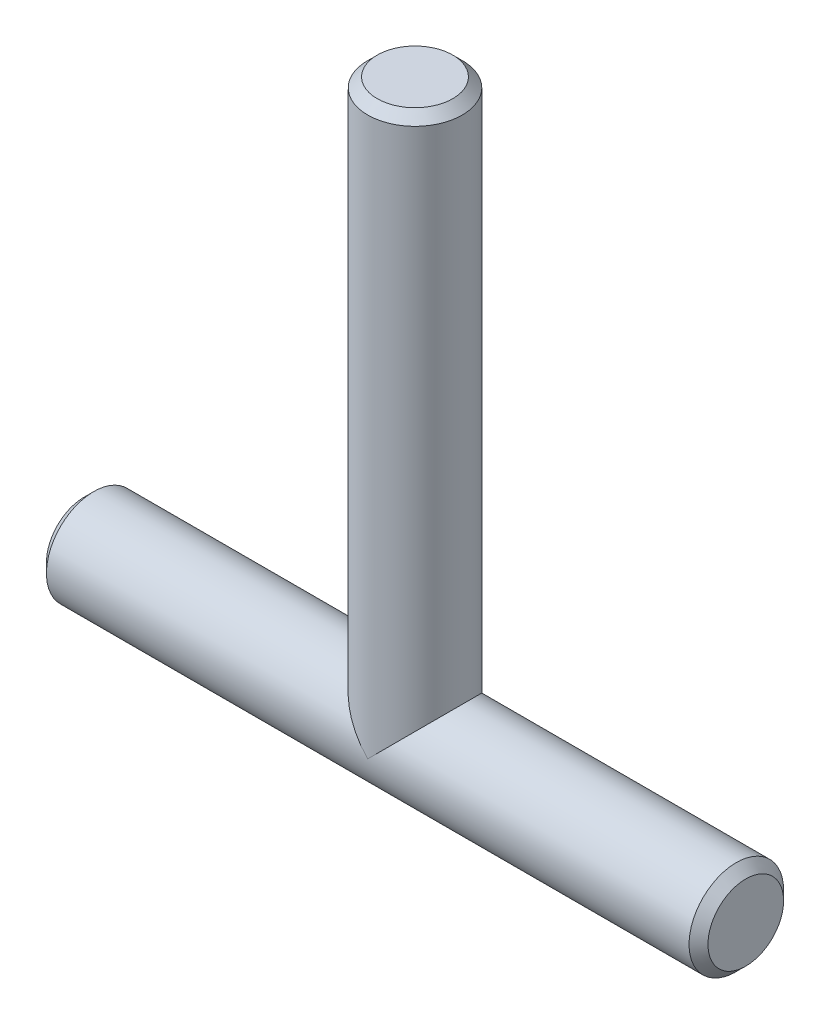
ISO-10303-21;
HEADER;
FILE_DESCRIPTION(('STEP AP214'),'2;1');
FILE_NAME('part.step','',(''),(''),'','','');
FILE_SCHEMA(('AUTOMOTIVE_DESIGN { 1 0 10303 214 1 1 1 1 }'));
ENDSEC;
DATA;
#1=APPLICATION_CONTEXT('core data for automotive mechanical design processes');
#2=APPLICATION_PROTOCOL_DEFINITION('international standard','automotive_design',2000,#1);
#3=PRODUCT_CONTEXT('',#1,'mechanical');
#4=PRODUCT('Part','Part','',(#3));
#5=PRODUCT_RELATED_PRODUCT_CATEGORY('part','',(#4));
#6=PRODUCT_DEFINITION_FORMATION('','',#4);
#7=PRODUCT_DEFINITION_CONTEXT('part definition',#1,'design');
#8=PRODUCT_DEFINITION('design','',#6,#7);
#9=PRODUCT_DEFINITION_SHAPE('','',#8);
#10=(LENGTH_UNIT() NAMED_UNIT(*) SI_UNIT(.MILLI.,.METRE.));
#11=(NAMED_UNIT(*) PLANE_ANGLE_UNIT() SI_UNIT($,.RADIAN.));
#12=(NAMED_UNIT(*) SI_UNIT($,.STERADIAN.) SOLID_ANGLE_UNIT());
#13=UNCERTAINTY_MEASURE_WITH_UNIT(LENGTH_MEASURE(1.E-05),#10,'distance_accuracy_value','');
#14=(GEOMETRIC_REPRESENTATION_CONTEXT(3) GLOBAL_UNCERTAINTY_ASSIGNED_CONTEXT((#13)) GLOBAL_UNIT_ASSIGNED_CONTEXT((#10,
#11,#12)) REPRESENTATION_CONTEXT('',''));
#15=CARTESIAN_POINT('',(0.,0.,0.));
#16=DIRECTION('',(0.,0.,1.));
#17=DIRECTION('',(1.,0.,0.));
#18=AXIS2_PLACEMENT_3D('',#15,#16,#17);
#19=CARTESIAN_POINT('',(35.,0.,0.));
#20=DIRECTION('',(-1.,0.,0.));
#21=DIRECTION('',(0.,0.,1.));
#22=AXIS2_PLACEMENT_3D('',#19,#20,#21);
#23=CYLINDRICAL_SURFACE('',#22,5.);
#24=CARTESIAN_POINT('',(34.,0.,0.));
#25=DIRECTION('',(1.,0.,0.));
#26=DIRECTION('',(0.,0.,-1.));
#27=AXIS2_PLACEMENT_3D('',#24,#25,#26);
#28=CIRCLE('',#27,5.);
#29=CARTESIAN_POINT('',(34.,0.,-5.));
#30=VERTEX_POINT('',#29);
#31=EDGE_CURVE('E48',#30,#30,#28,.F.);
#32=ORIENTED_EDGE('',*,*,#31,.T.);
#33=EDGE_LOOP('',(#32));
#34=FACE_BOUND('',#33,.T.);
#35=CARTESIAN_POINT('',(-34.,0.,0.));
#36=DIRECTION('',(1.,0.,0.));
#37=DIRECTION('',(0.,0.,-1.));
#38=AXIS2_PLACEMENT_3D('',#35,#36,#37);
#39=CIRCLE('',#38,5.);
#40=CARTESIAN_POINT('',(-34.,0.,-5.));
#41=VERTEX_POINT('',#40);
#42=EDGE_CURVE('E71',#41,#41,#39,.T.);
#43=ORIENTED_EDGE('',*,*,#42,.T.);
#44=EDGE_LOOP('',(#43));
#45=FACE_BOUND('',#44,.T.);
#46=CARTESIAN_POINT('',(0.,0.,0.));
#47=DIRECTION('',(-0.707106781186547,-0.707106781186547,0.));
#48=DIRECTION('',(-0.707106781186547,0.707106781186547,0.));
#49=AXIS2_PLACEMENT_3D('',#46,#47,#48);
#50=ELLIPSE('',#49,7.07106781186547,5.);
#51=CARTESIAN_POINT('',(0.,0.,-5.));
#52=VERTEX_POINT('',#51);
#53=CARTESIAN_POINT('',(0.,0.,5.));
#54=VERTEX_POINT('',#53);
#55=EDGE_CURVE('E56',#52,#54,#50,.F.);
#56=ORIENTED_EDGE('',*,*,#55,.F.);
#57=CARTESIAN_POINT('',(0.,0.,0.));
#58=DIRECTION('',(-0.707106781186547,0.707106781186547,0.));
#59=DIRECTION('',(-0.707106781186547,-0.707106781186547,0.));
#60=AXIS2_PLACEMENT_3D('',#57,#58,#59);
#61=ELLIPSE('',#60,7.07106781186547,5.);
#62=EDGE_CURVE('E54',#54,#52,#61,.T.);
#63=ORIENTED_EDGE('',*,*,#62,.F.);
#64=EDGE_LOOP('',(#56,#63));
#65=FACE_BOUND('',#64,.T.);
#66=ADVANCED_FACE('F40',(#34,#45,#65),#23,.T.);
#67=CARTESIAN_POINT('',(35.,0.,0.));
#68=DIRECTION('',(1.,0.,0.));
#69=DIRECTION('',(0.,0.,-1.));
#70=AXIS2_PLACEMENT_3D('',#67,#68,#69);
#71=PLANE('',#70);
#72=CARTESIAN_POINT('',(35.,0.,0.));
#73=DIRECTION('',(1.,0.,0.));
#74=DIRECTION('',(0.,0.,-1.));
#75=AXIS2_PLACEMENT_3D('',#72,#73,#74);
#76=CIRCLE('',#75,3.99999999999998);
#77=CARTESIAN_POINT('',(35.,0.,-3.99999999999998));
#78=VERTEX_POINT('',#77);
#79=EDGE_CURVE('E68',#78,#78,#76,.T.);
#80=ORIENTED_EDGE('',*,*,#79,.T.);
#81=EDGE_LOOP('',(#80));
#82=FACE_BOUND('',#81,.T.);
#83=ADVANCED_FACE('F84',(#82),#71,.T.);
#84=CARTESIAN_POINT('',(-35.,0.,0.));
#85=DIRECTION('',(1.,0.,0.));
#86=DIRECTION('',(0.,0.,-1.));
#87=AXIS2_PLACEMENT_3D('',#84,#85,#86);
#88=PLANE('',#87);
#89=CARTESIAN_POINT('',(-35.,0.,0.));
#90=DIRECTION('',(1.,0.,0.));
#91=DIRECTION('',(0.,0.,-1.));
#92=AXIS2_PLACEMENT_3D('',#89,#90,#91);
#93=CIRCLE('',#92,3.99999999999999);
#94=CARTESIAN_POINT('',(-35.,0.,-3.99999999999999));
#95=VERTEX_POINT('',#94);
#96=EDGE_CURVE('E11',#95,#95,#93,.F.);
#97=ORIENTED_EDGE('',*,*,#96,.T.);
#98=EDGE_LOOP('',(#97));
#99=FACE_BOUND('',#98,.T.);
#100=ADVANCED_FACE('F86',(#99),#88,.F.);
#101=CARTESIAN_POINT('',(0.,60.,0.));
#102=DIRECTION('',(0.,-1.,0.));
#103=DIRECTION('',(0.,0.,-1.));
#104=AXIS2_PLACEMENT_3D('',#101,#102,#103);
#105=CYLINDRICAL_SURFACE('',#104,5.);
#106=CARTESIAN_POINT('',(0.,59.,0.));
#107=DIRECTION('',(0.,1.,0.));
#108=DIRECTION('',(0.,0.,1.));
#109=AXIS2_PLACEMENT_3D('',#106,#107,#108);
#110=CIRCLE('',#109,5.);
#111=CARTESIAN_POINT('',(0.,59.,5.));
#112=VERTEX_POINT('',#111);
#113=EDGE_CURVE('E65',#112,#112,#110,.F.);
#114=ORIENTED_EDGE('',*,*,#113,.T.);
#115=EDGE_LOOP('',(#114));
#116=FACE_BOUND('',#115,.T.);
#117=ORIENTED_EDGE('',*,*,#62,.T.);
#118=ORIENTED_EDGE('',*,*,#55,.T.);
#119=EDGE_LOOP('',(#117,#118));
#120=FACE_BOUND('',#119,.T.);
#121=ADVANCED_FACE('F60',(#116,#120),#105,.T.);
#122=CARTESIAN_POINT('',(0.,60.,0.));
#123=DIRECTION('',(0.,1.,0.));
#124=DIRECTION('',(0.,0.,1.));
#125=AXIS2_PLACEMENT_3D('',#122,#123,#124);
#126=PLANE('',#125);
#127=CARTESIAN_POINT('',(0.,60.,0.));
#128=DIRECTION('',(0.,1.,0.));
#129=DIRECTION('',(0.,0.,1.));
#130=AXIS2_PLACEMENT_3D('',#127,#128,#129);
#131=CIRCLE('',#130,3.99999999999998);
#132=CARTESIAN_POINT('',(0.,60.,3.99999999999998));
#133=VERTEX_POINT('',#132);
#134=EDGE_CURVE('E58',#133,#133,#131,.T.);
#135=ORIENTED_EDGE('',*,*,#134,.T.);
#136=EDGE_LOOP('',(#135));
#137=FACE_BOUND('',#136,.T.);
#138=ADVANCED_FACE('F99',(#137),#126,.T.);
#139=CARTESIAN_POINT('',(0.,60.,0.));
#140=DIRECTION('',(0.,-1.,0.));
#141=DIRECTION('',(0.,0.,-1.));
#142=AXIS2_PLACEMENT_3D('',#139,#140,#141);
#143=CONICAL_SURFACE('',#142,3.99999999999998,0.785398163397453);
#144=ORIENTED_EDGE('',*,*,#113,.F.);
#145=EDGE_LOOP('',(#144));
#146=FACE_BOUND('',#145,.T.);
#147=ORIENTED_EDGE('',*,*,#134,.F.);
#148=EDGE_LOOP('',(#147));
#149=FACE_BOUND('',#148,.T.);
#150=ADVANCED_FACE('F81',(#146,#149),#143,.T.);
#151=CARTESIAN_POINT('',(35.,0.,0.));
#152=DIRECTION('',(-1.,0.,0.));
#153=DIRECTION('',(0.,0.,1.));
#154=AXIS2_PLACEMENT_3D('',#151,#152,#153);
#155=CONICAL_SURFACE('',#154,3.99999999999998,0.785398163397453);
#156=ORIENTED_EDGE('',*,*,#31,.F.);
#157=EDGE_LOOP('',(#156));
#158=FACE_BOUND('',#157,.T.);
#159=ORIENTED_EDGE('',*,*,#79,.F.);
#160=EDGE_LOOP('',(#159));
#161=FACE_BOUND('',#160,.T.);
#162=ADVANCED_FACE('F78',(#158,#161),#155,.T.);
#163=CARTESIAN_POINT('',(-34.,0.,0.));
#164=DIRECTION('',(1.,0.,0.));
#165=DIRECTION('',(0.,0.,-1.));
#166=AXIS2_PLACEMENT_3D('',#163,#164,#165);
#167=CONICAL_SURFACE('',#166,5.,0.785398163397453);
#168=ORIENTED_EDGE('',*,*,#96,.F.);
#169=EDGE_LOOP('',(#168));
#170=FACE_BOUND('',#169,.T.);
#171=ORIENTED_EDGE('',*,*,#42,.F.);
#172=EDGE_LOOP('',(#171));
#173=FACE_BOUND('',#172,.T.);
#174=ADVANCED_FACE('F42',(#170,#173),#167,.T.);
#175=CLOSED_SHELL('',(#66,#83,#100,#121,#138,#150,#162,#174));
#176=MANIFOLD_SOLID_BREP('B2',#175);
#177=ADVANCED_BREP_SHAPE_REPRESENTATION('',(#18,#176),#14);
#178=SHAPE_DEFINITION_REPRESENTATION(#9,#177);
ENDSEC;
END-ISO-10303-21;
